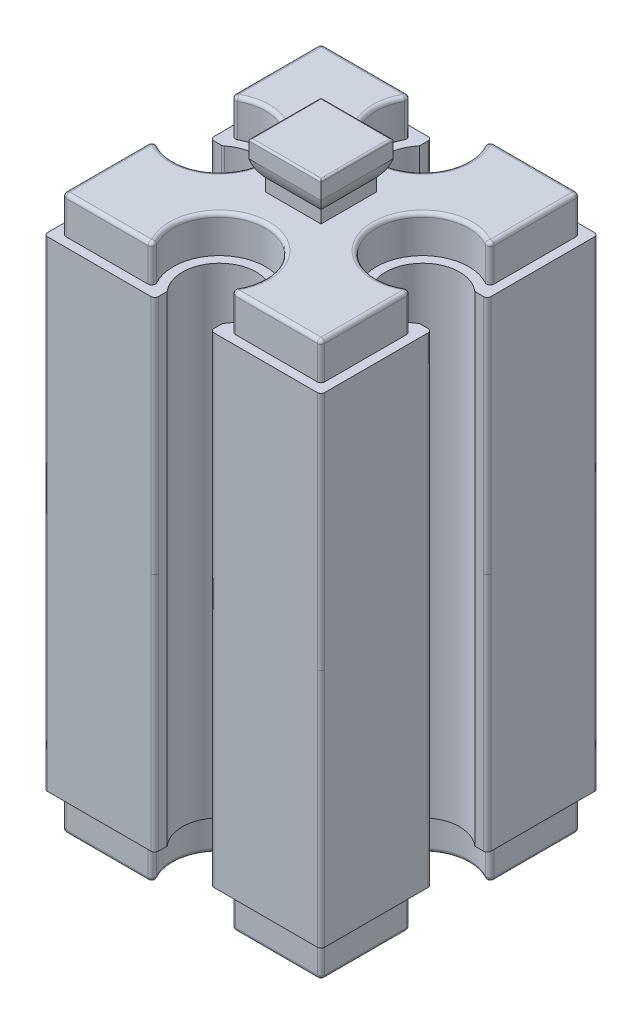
from build123d import *

# Parameters (mm, degrees)
EXTRUDE_1_DEPTH        = 13
EXTRUDE_2_DEPTH        = 2
EXTRUDE_3_DEPTH        = 2
FILLET_3_R             = 0.2
CUT_EXTRUDE_1_DEPTH    = 3
FILLET_4_R             = 0.2
FILLET_5_R             = 0.1
FILLET_3_OF_MIRROR_1_R = 0.2
FILLET_4_OF_MIRROR_1_R = 0.2
FILLET_5_OF_MIRROR_1_R = 0.1


with BuildPart() as part:
    # Sketch 1 → Extrude 1 (new body)
    with BuildSketch(Plane(origin=(0, 0, 0), x_dir=(1, 0, 0), z_dir=(0, 1, 0))):
        with BuildLine():
            Line((-7.5, 7.5), (-1.5, 7.5))
            Line((-1.5, 7.5), (-1.5, 6.822875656))
            ThreePointArc((-1.5, 6.822875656), (0, 3.5), (1.5, 6.822875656))
            Line((1.5, 6.822875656), (1.5, 7.5))
            Line((1.5, 7.5), (7.5, 7.5))
            Line((7.5, 7.5), (7.5, 1.5))
            Line((7.5, 1.5), (6.822875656, 1.5))
            ThreePointArc((6.822875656, 1.5), (3.5, 0), (6.822875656, -1.5))
            Line((6.822875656, -1.5), (7.5, -1.5))
            Line((7.5, -1.5), (7.5, -7.5))
            Line((7.5, -7.5), (1.5, -7.5))
            Line((1.5, -7.5), (1.5, -6.822875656))
            ThreePointArc((1.5, -6.822875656), (0, -3.5), (-1.5, -6.822875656))
            Line((-1.5, -6.822875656), (-1.5, -7.5))
            Line((-1.5, -7.5), (-7.5, -7.5))
            Line((-7.5, -7.5), (-7.5, -1.5))
            Line((-7.5, -1.5), (-6.822875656, -1.5))
            ThreePointArc((-6.822875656, -1.5), (-3.5, 0), (-6.822875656, 1.5))
            Line((-6.822875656, 1.5), (-7.5, 1.5))
            Line((-7.5, 1.5), (-7.5, 7.5))
        make_face()
    extrude_1 = extrude(amount=EXTRUDE_1_DEPTH)

    # Sketch 2 → Extrude 2 (add)
    with BuildSketch(Plane(origin=(0, 13, 0), x_dir=(1, 0, 0), z_dir=(0, 1, 0))):
        with BuildLine():
            Line((-7, 7), (-7, 2))
            ThreePointArc((-7, 2), (-3, 0), (-7, -2))
            Line((-7, -2), (-7, -7))
            Line((-7, -7), (-2, -7))
            ThreePointArc((-2, -7), (0, -3), (2, -7))
            Line((2, -7), (7, -7))
            Line((7, -7), (7, -2))
            ThreePointArc((7, -2), (3, 0), (7, 2))
            Line((7, 2), (7, 7))
            Line((7, 7), (2, 7))
            ThreePointArc((2, 7), (0, 3), (-2, 7))
            Line((-2, 7), (-7, 7))
        make_face()
    extrude_2 = extrude(amount=EXTRUDE_2_DEPTH)

    # Sketch 3 → Extrude 3 (add, symmetric)
    with BuildSketch(Plane(origin=(0, 0, 0), x_dir=(0, 0, -1), z_dir=(1, 0, 0))):
        with BuildLine():
            Line((-1.5, 15), (1.5, 15))
            Line((1.5, 15), (1.5, 15.677124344))
            ThreePointArc((1.5, 15.677124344), (1.780042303, 16.088161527), (1.95, 16.555590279))
            Line((1.95, 16.555590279), (1.95, 17.5))
            Line((1.95, 17.5), (-1.95, 17.5))
            Line((-1.95, 17.5), (-1.95, 16.555590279))
            ThreePointArc((-1.95, 16.555590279), (-1.780042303, 16.088161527), (-1.5, 15.677124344))
            Line((-1.5, 15.677124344), (-1.5, 15))
        make_face()
    extrude_3 = extrude(amount=EXTRUDE_3_DEPTH, both=True)

    # Fillet 3
    fillet_3_edges = [part.edges().sort_by_distance(p)[0] for p in [
        (-7.5, 6.5, -7.5),
        (-1.5, 6.5, -7.5),
        (1.5, 6.5, -7.5),
        (7.5, 6.5, -7.5),
        (7.5, 6.5, -1.5),
        (7.5, 6.5, 1.5),
        (7.5, 6.5, 7.5),
        (1.5, 6.5, 7.5),
        (-1.5, 6.5, 7.5),
        (-7.5, 6.5, 7.5),
        (-7.5, 6.5, 1.5),
        (-6.822875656, 6.5, -1.5),
        (-7.5, 6.5, -1.5),
    ]]
    fillet(fillet_3_edges, radius=FILLET_3_R)

    # Sketch 4 → Cut-Extrude 1 (cut, symmetric)
    with BuildSketch(Plane.XY):
        with BuildLine():
            Line((1.95, 17.5), (2, 17.5))
            Line((2, 17.5), (2, 15))
            Line((2, 15), (1.5, 15))
            Line((1.5, 15), (1.5, 15.677124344))
            ThreePointArc((1.5, 15.677124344), (1.780042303, 16.088161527), (1.95, 16.555590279))
            Line((1.95, 16.555590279), (1.95, 17.5))
        make_face()
        with BuildLine():
            Line((-1.95, 17.5), (-1.95, 16.555590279))
            ThreePointArc((-1.95, 16.555590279), (-1.780042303, 16.088161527), (-1.5, 15.677124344))
            Line((-1.5, 15.677124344), (-1.5, 15))
            Line((-1.5, 15), (-2, 15))
            Line((-2, 15), (-2, 17.5))
            Line((-2, 17.5), (-1.95, 17.5))
        make_face()
    cut_extrude_1 = extrude(amount=CUT_EXTRUDE_1_DEPTH, both=True, mode=Mode.SUBTRACT)

    # Fillet 4
    fillet_4_edges = [part.edges().sort_by_distance(p)[0] for p in [
        (-2, 14, -7),
        (-7, 14, -7),
        (-7, 14, -2),
        (-7, 14, 2),
        (-7, 14, 7),
        (-2, 14, 7),
        (2, 14, 7),
        (7, 14, 7),
        (7, 14, 2),
        (7, 14, -2),
        (7, 14, -7),
        (2, 14, -7),
        (-4.5, 15, -7),
        (-7, 15, -4.5),
        (-3, 15, 0),
        (-7, 15, 4.5),
        (-4.5, 15, 7),
        (0, 15, 3),
        (4.5, 15, 7),
        (7, 15, 4.5),
        (3, 15, 0),
        (7, 15, -4.5),
        (4.5, 15, -7),
        (0, 15, -3),
    ]]
    fillet(fillet_4_edges, radius=FILLET_4_R)

    # Fillet 5
    fillet_5_edges = [part.edges().sort_by_distance(p)[0] for p in [
        (1.95, 17.5, 0),
        (0, 17.5, -1.95),
        (0, 17.5, 1.95),
        (-1.95, 17.5, 0),
    ]]
    fillet(fillet_5_edges, radius=FILLET_5_R)


with BuildPart() as mirror_1_1:
    # Mirror 1: Extrude 1, Extrude 2, Extrude 3 across Top Plane
    add(extrude_1.mirror(Plane(origin=(0, 0, 0), x_dir=(1, 0, 0), z_dir=(0, 1, 0))))
    add(extrude_2.mirror(Plane(origin=(0, 0, 0), x_dir=(1, 0, 0), z_dir=(0, 1, 0))))
    add(extrude_3.mirror(Plane(origin=(0, 0, 0), x_dir=(1, 0, 0), z_dir=(0, 1, 0))))

    # Mirror 1 2: Cut-Extrude 1 across Top Plane
    add(cut_extrude_1.mirror(Plane(origin=(0, 0, 0), x_dir=(1, 0, 0), z_dir=(0, 1, 0))), mode=Mode.SUBTRACT)

    # Fillet 3 of Mirror 1
    fillet_3_of_mirror_1_edges = [mirror_1_1.edges().sort_by_distance(p)[0] for p in [
        (-7.5, -6.5, -7.5),
        (-1.5, -6.5, -7.5),
        (1.5, -6.5, -7.5),
        (7.5, -6.5, -7.5),
        (7.5, -6.5, -1.5),
        (7.5, -6.5, 1.5),
        (7.5, -6.5, 7.5),
        (1.5, -6.5, 7.5),
        (-1.5, -6.5, 7.5),
        (-7.5, -6.5, 7.5),
        (-7.5, -6.5, 1.5),
        (-6.822875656, -6.5, -1.5),
        (-7.5, -6.5, -1.5),
    ]]
    fillet(fillet_3_of_mirror_1_edges, radius=FILLET_3_OF_MIRROR_1_R)

    # Fillet 4 of Mirror 1
    fillet_4_of_mirror_1_edges = [mirror_1_1.edges().sort_by_distance(p)[0] for p in [
        (-2, -14, -7),
        (-7, -14, -7),
        (-7, -14, -2),
        (-7, -14, 2),
        (-7, -14, 7),
        (-2, -14, 7),
        (2, -14, 7),
        (7, -14, 7),
        (7, -14, 2),
        (7, -14, -2),
        (7, -14, -7),
        (2, -14, -7),
        (-4.5, -15, -7),
        (-7, -15, -4.5),
        (-3, -15, 0),
        (-7, -15, 4.5),
        (-4.5, -15, 7),
        (0, -15, 3),
        (4.5, -15, 7),
        (7, -15, 4.5),
        (3, -15, 0),
        (7, -15, -4.5),
        (4.5, -15, -7),
        (0, -15, -3),
    ]]
    fillet(fillet_4_of_mirror_1_edges, radius=FILLET_4_OF_MIRROR_1_R)

    # Fillet 5 of Mirror 1
    fillet_5_of_mirror_1_edges = [mirror_1_1.edges().sort_by_distance(p)[0] for p in [
        (1.95, -17.5, 0),
        (0, -17.5, -1.95),
        (0, -17.5, 1.95),
        (-1.95, -17.5, 0),
    ]]
    fillet(fillet_5_of_mirror_1_edges, radius=FILLET_5_OF_MIRROR_1_R)


with BuildPart() as part_1:
    add(part.part)

    # Mirror 1 united with what the copies tou: union Mirror 1_1
    add(mirror_1_1.part)


solid = part_1.part
